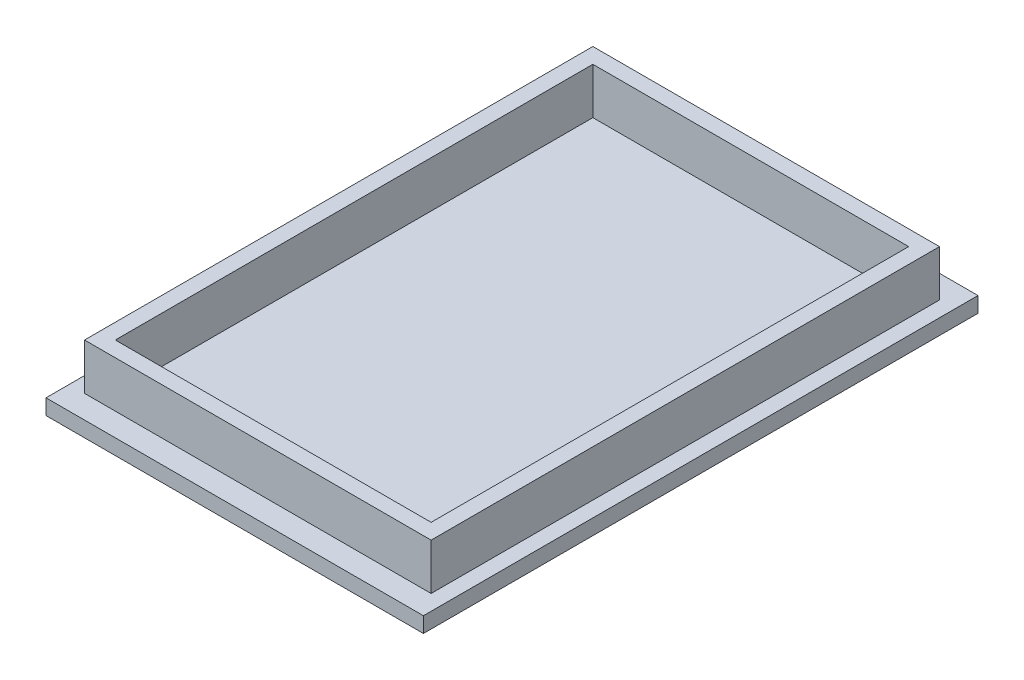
from build123d import *

# Parameters (mm, degrees)
SKETCH1_W           = 45
SKETCH1_H           = 66
BOSS_EXTRUDE1_DEPTH = 2
BOSS_EXTRUDE2_DEPTH = 2
SKETCH1_4_W         = 45
SKETCH1_4_H         = 66
BOSS_EXTRUDE3_DEPTH = 6
SKETCH1_5_W         = 45
SKETCH1_5_H         = 66
BOSS_EXTRUDE4_DEPTH = 2


with BuildPart() as part:
    # Sketch1 → Boss-Extrude1 (new body)
    with BuildSketch(Plane(origin=(0, 0, 0), x_dir=(1, 0, 0), z_dir=(0, 1, 0))):
        Polygon((-22.5, 69), (-47, 69), (-47, 33), (-47, -3), (-22.5, -3), (2, -3), (2, 25.423469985), (2, 69), align=None)
        with Locations((-22.5, 33)):
            Rectangle(SKETCH1_W, SKETCH1_H, mode=Mode.SUBTRACT)
    extrude(amount=-BOSS_EXTRUDE1_DEPTH)



with BuildPart() as body_2:
    # Sketch1_3 → Boss-Extrude2 (new body)
    with BuildSketch(Plane(origin=(0, 0, 0), x_dir=(1, 0, 0), z_dir=(0, 1, 0))):
        Polygon((-2, 25.423469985), (-2, 64), (-22.5, 64), (-43, 64), (-43, 33), (-43, 2), (-22.5, 2), (-2, 2), align=None)
    extrude(amount=-BOSS_EXTRUDE2_DEPTH)


with BuildPart() as body_3:
    # Sketch1_4 → Boss-Extrude3 (new body)
    with BuildSketch(Plane(origin=(0, 0, 0), x_dir=(1, 0, 0), z_dir=(0, 1, 0))):
        with Locations((-22.5, 33)):
            Rectangle(SKETCH1_4_W, SKETCH1_4_H)
        Polygon((-2, 64), (-22.5, 64), (-43, 64), (-43, 33), (-43, 2), (-22.5, 2), (-2, 2), (-2, 25.423469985), align=None, mode=Mode.SUBTRACT)
    extrude(amount=BOSS_EXTRUDE3_DEPTH)


with BuildPart() as part_1:
    add(part.part)

    add(body_2.part)  # Boss-Extrude4 merges body 2

    add(body_3.part)  # Boss-Extrude4 merges body 3
    # Sketch1_5 → Boss-Extrude4 (add)
    with BuildSketch(Plane(origin=(0, 0, 0), x_dir=(1, 0, 0), z_dir=(0, 1, 0))):
        with Locations((-22.5, 33)):
            Rectangle(SKETCH1_5_W, SKETCH1_5_H)
        Polygon((-2, 64), (-22.5, 64), (-43, 64), (-43, 33), (-43, 2), (-22.5, 2), (-2, 2), (-2, 25.423469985), align=None, mode=Mode.SUBTRACT)
    extrude(amount=-BOSS_EXTRUDE4_DEPTH)


solid = part_1.part
